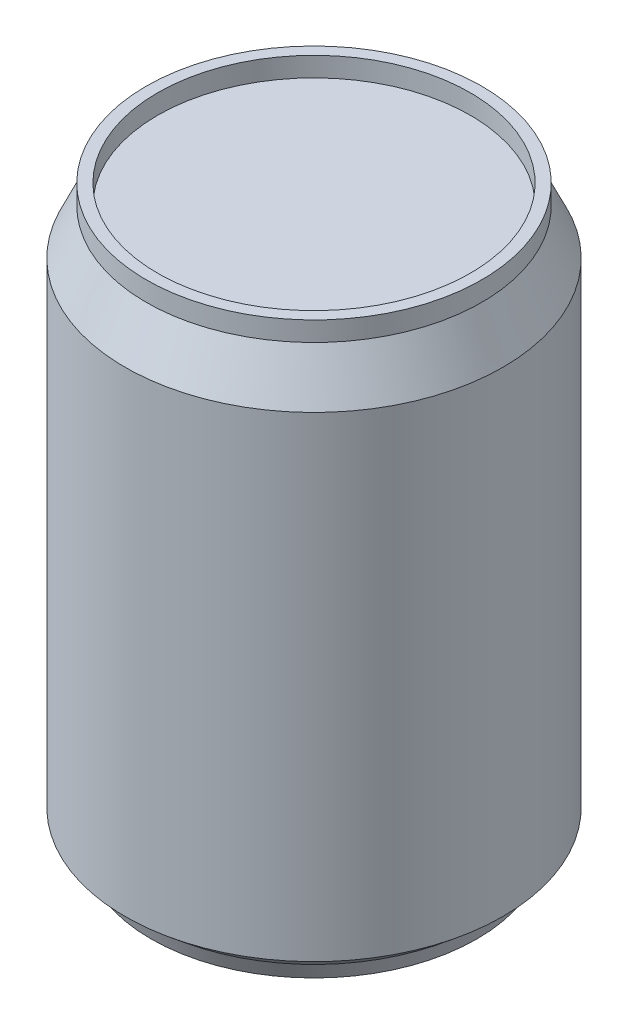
ISO-10303-21;
HEADER;
FILE_DESCRIPTION(('STEP AP214'),'2;1');
FILE_NAME('part.step','',(''),(''),'','','');
FILE_SCHEMA(('AUTOMOTIVE_DESIGN { 1 0 10303 214 1 1 1 1 }'));
ENDSEC;
DATA;
#1=APPLICATION_CONTEXT('core data for automotive mechanical design processes');
#2=APPLICATION_PROTOCOL_DEFINITION('international standard','automotive_design',2000,#1);
#3=PRODUCT_CONTEXT('',#1,'mechanical');
#4=PRODUCT('Part','Part','',(#3));
#5=PRODUCT_RELATED_PRODUCT_CATEGORY('part','',(#4));
#6=PRODUCT_DEFINITION_FORMATION('','',#4);
#7=PRODUCT_DEFINITION_CONTEXT('part definition',#1,'design');
#8=PRODUCT_DEFINITION('design','',#6,#7);
#9=PRODUCT_DEFINITION_SHAPE('','',#8);
#10=(LENGTH_UNIT() NAMED_UNIT(*) SI_UNIT(.MILLI.,.METRE.));
#11=(NAMED_UNIT(*) PLANE_ANGLE_UNIT() SI_UNIT($,.RADIAN.));
#12=(NAMED_UNIT(*) SI_UNIT($,.STERADIAN.) SOLID_ANGLE_UNIT());
#13=UNCERTAINTY_MEASURE_WITH_UNIT(LENGTH_MEASURE(1.E-05),#10,'distance_accuracy_value','');
#14=(GEOMETRIC_REPRESENTATION_CONTEXT(3) GLOBAL_UNCERTAINTY_ASSIGNED_CONTEXT((#13)) GLOBAL_UNIT_ASSIGNED_CONTEXT((#10,
#11,#12)) REPRESENTATION_CONTEXT('',''));
#15=CARTESIAN_POINT('',(0.,0.,0.));
#16=DIRECTION('',(0.,0.,1.));
#17=DIRECTION('',(1.,0.,0.));
#18=AXIS2_PLACEMENT_3D('',#15,#16,#17);
#19=CARTESIAN_POINT('',(0.,85.,0.));
#20=DIRECTION('',(0.,1.,0.));
#21=DIRECTION('',(-1.,0.,0.));
#22=AXIS2_PLACEMENT_3D('',#19,#20,#21);
#23=PLANE('',#22);
#24=CARTESIAN_POINT('',(0.,85.,0.));
#25=DIRECTION('',(0.,1.,0.));
#26=DIRECTION('',(-1.,0.,0.));
#27=AXIS2_PLACEMENT_3D('',#24,#25,#26);
#28=CIRCLE('',#27,24.);
#29=CARTESIAN_POINT('',(-24.,85.,0.));
#30=VERTEX_POINT('',#29);
#31=EDGE_CURVE('E10',#30,#30,#28,.T.);
#32=ORIENTED_EDGE('',*,*,#31,.T.);
#33=EDGE_LOOP('',(#32));
#34=FACE_BOUND('',#33,.T.);
#35=ADVANCED_FACE('F38',(#34),#23,.T.);
#36=CARTESIAN_POINT('',(0.,85.,0.));
#37=DIRECTION('',(0.,1.,0.));
#38=DIRECTION('',(-1.,0.,0.));
#39=AXIS2_PLACEMENT_3D('',#36,#37,#38);
#40=CYLINDRICAL_SURFACE('',#39,24.);
#41=CARTESIAN_POINT('',(0.,88.,0.));
#42=DIRECTION('',(0.,1.,0.));
#43=DIRECTION('',(-1.,0.,0.));
#44=AXIS2_PLACEMENT_3D('',#41,#42,#43);
#45=CIRCLE('',#44,24.);
#46=CARTESIAN_POINT('',(-24.,88.,0.));
#47=VERTEX_POINT('',#46);
#48=EDGE_CURVE('E44',#47,#47,#45,.T.);
#49=ORIENTED_EDGE('',*,*,#48,.T.);
#50=EDGE_LOOP('',(#49));
#51=FACE_BOUND('',#50,.T.);
#52=ORIENTED_EDGE('',*,*,#31,.F.);
#53=EDGE_LOOP('',(#52));
#54=FACE_BOUND('',#53,.T.);
#55=ADVANCED_FACE('F88',(#51,#54),#40,.F.);
#56=CARTESIAN_POINT('',(-24.,88.,0.));
#57=DIRECTION('',(0.,1.,0.));
#58=DIRECTION('',(-1.,0.,0.));
#59=AXIS2_PLACEMENT_3D('',#56,#57,#58);
#60=PLANE('',#59);
#61=CARTESIAN_POINT('',(0.,88.,0.));
#62=DIRECTION('',(0.,1.,0.));
#63=DIRECTION('',(-1.,0.,0.));
#64=AXIS2_PLACEMENT_3D('',#61,#62,#63);
#65=CIRCLE('',#64,25.75);
#66=CARTESIAN_POINT('',(-25.75,88.,0.));
#67=VERTEX_POINT('',#66);
#68=EDGE_CURVE('E48',#67,#67,#65,.T.);
#69=ORIENTED_EDGE('',*,*,#68,.T.);
#70=EDGE_LOOP('',(#69));
#71=FACE_BOUND('',#70,.T.);
#72=ORIENTED_EDGE('',*,*,#48,.F.);
#73=EDGE_LOOP('',(#72));
#74=FACE_BOUND('',#73,.T.);
#75=ADVANCED_FACE('F92',(#71,#74),#60,.T.);
#76=CARTESIAN_POINT('',(0.,85.,0.));
#77=DIRECTION('',(0.,1.,0.));
#78=DIRECTION('',(-1.,0.,0.));
#79=AXIS2_PLACEMENT_3D('',#76,#77,#78);
#80=CYLINDRICAL_SURFACE('',#79,25.75);
#81=CARTESIAN_POINT('',(0.,85.,0.));
#82=DIRECTION('',(0.,1.,0.));
#83=DIRECTION('',(-1.,0.,0.));
#84=AXIS2_PLACEMENT_3D('',#81,#82,#83);
#85=CIRCLE('',#84,25.75);
#86=CARTESIAN_POINT('',(-25.75,85.,0.));
#87=VERTEX_POINT('',#86);
#88=EDGE_CURVE('E52',#87,#87,#85,.T.);
#89=ORIENTED_EDGE('',*,*,#88,.T.);
#90=EDGE_LOOP('',(#89));
#91=FACE_BOUND('',#90,.T.);
#92=ORIENTED_EDGE('',*,*,#68,.F.);
#93=EDGE_LOOP('',(#92));
#94=FACE_BOUND('',#93,.T.);
#95=ADVANCED_FACE('F96',(#91,#94),#80,.T.);
#96=CARTESIAN_POINT('',(0.,85.,0.));
#97=DIRECTION('',(0.,-1.,0.));
#98=DIRECTION('',(1.,0.,0.));
#99=AXIS2_PLACEMENT_3D('',#96,#97,#98);
#100=CONICAL_SURFACE('',#99,25.75,0.434670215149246);
#101=CARTESIAN_POINT('',(0.,78.,0.));
#102=DIRECTION('',(0.,1.,0.));
#103=DIRECTION('',(-1.,0.,0.));
#104=AXIS2_PLACEMENT_3D('',#101,#102,#103);
#105=CIRCLE('',#104,29.);
#106=CARTESIAN_POINT('',(-29.,78.,0.));
#107=VERTEX_POINT('',#106);
#108=EDGE_CURVE('E57',#107,#107,#105,.T.);
#109=ORIENTED_EDGE('',*,*,#108,.T.);
#110=EDGE_LOOP('',(#109));
#111=FACE_BOUND('',#110,.T.);
#112=ORIENTED_EDGE('',*,*,#88,.F.);
#113=EDGE_LOOP('',(#112));
#114=FACE_BOUND('',#113,.T.);
#115=ADVANCED_FACE('F103',(#111,#114),#100,.T.);
#116=CARTESIAN_POINT('',(0.,85.,0.));
#117=DIRECTION('',(0.,1.,0.));
#118=DIRECTION('',(-1.,0.,0.));
#119=AXIS2_PLACEMENT_3D('',#116,#117,#118);
#120=CYLINDRICAL_SURFACE('',#119,29.);
#121=CARTESIAN_POINT('',(0.,5.,0.));
#122=DIRECTION('',(0.,1.,0.));
#123=DIRECTION('',(-1.,0.,0.));
#124=AXIS2_PLACEMENT_3D('',#121,#122,#123);
#125=CIRCLE('',#124,29.);
#126=CARTESIAN_POINT('',(-29.,5.00000000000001,0.));
#127=VERTEX_POINT('',#126);
#128=EDGE_CURVE('E60',#127,#127,#125,.T.);
#129=ORIENTED_EDGE('',*,*,#128,.T.);
#130=EDGE_LOOP('',(#129));
#131=FACE_BOUND('',#130,.T.);
#132=ORIENTED_EDGE('',*,*,#108,.F.);
#133=EDGE_LOOP('',(#132));
#134=FACE_BOUND('',#133,.T.);
#135=ADVANCED_FACE('F107',(#131,#134),#120,.T.);
#136=CARTESIAN_POINT('',(0.,5.,0.));
#137=DIRECTION('',(0.,1.,0.));
#138=DIRECTION('',(-1.,0.,0.));
#139=AXIS2_PLACEMENT_3D('',#136,#137,#138);
#140=CONICAL_SURFACE('',#139,29.,0.876058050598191);
#141=CARTESIAN_POINT('',(0.,2.5,0.));
#142=DIRECTION('',(0.,1.,0.));
#143=DIRECTION('',(-1.,0.,0.));
#144=AXIS2_PLACEMENT_3D('',#141,#142,#143);
#145=CIRCLE('',#144,26.);
#146=CARTESIAN_POINT('',(-26.,2.5,0.));
#147=VERTEX_POINT('',#146);
#148=EDGE_CURVE('E63',#147,#147,#145,.T.);
#149=ORIENTED_EDGE('',*,*,#148,.T.);
#150=EDGE_LOOP('',(#149));
#151=FACE_BOUND('',#150,.T.);
#152=ORIENTED_EDGE('',*,*,#128,.F.);
#153=EDGE_LOOP('',(#152));
#154=FACE_BOUND('',#153,.T.);
#155=ADVANCED_FACE('F111',(#151,#154),#140,.T.);
#156=CARTESIAN_POINT('',(0.,2.5,0.));
#157=DIRECTION('',(0.,1.,0.));
#158=DIRECTION('',(-1.,0.,0.));
#159=AXIS2_PLACEMENT_3D('',#156,#157,#158);
#160=CONICAL_SURFACE('',#159,26.,0.380506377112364);
#161=CARTESIAN_POINT('',(0.,0.,0.));
#162=DIRECTION('',(0.,1.,0.));
#163=DIRECTION('',(-1.,0.,0.));
#164=AXIS2_PLACEMENT_3D('',#161,#162,#163);
#165=CIRCLE('',#164,25.);
#166=CARTESIAN_POINT('',(-25.,0.,0.));
#167=VERTEX_POINT('',#166);
#168=EDGE_CURVE('E66',#167,#167,#165,.T.);
#169=ORIENTED_EDGE('',*,*,#168,.T.);
#170=EDGE_LOOP('',(#169));
#171=FACE_BOUND('',#170,.T.);
#172=ORIENTED_EDGE('',*,*,#148,.F.);
#173=EDGE_LOOP('',(#172));
#174=FACE_BOUND('',#173,.T.);
#175=ADVANCED_FACE('F115',(#171,#174),#160,.T.);
#176=CARTESIAN_POINT('',(-25.,0.,0.));
#177=DIRECTION('',(0.,-1.,0.));
#178=DIRECTION('',(1.,0.,0.));
#179=AXIS2_PLACEMENT_3D('',#176,#177,#178);
#180=PLANE('',#179);
#181=CARTESIAN_POINT('',(0.,0.,0.));
#182=DIRECTION('',(0.,1.,0.));
#183=DIRECTION('',(-1.,0.,0.));
#184=AXIS2_PLACEMENT_3D('',#181,#182,#183);
#185=CIRCLE('',#184,22.);
#186=CARTESIAN_POINT('',(-22.,0.,0.));
#187=VERTEX_POINT('',#186);
#188=EDGE_CURVE('E69',#187,#187,#185,.T.);
#189=ORIENTED_EDGE('',*,*,#188,.T.);
#190=EDGE_LOOP('',(#189));
#191=FACE_BOUND('',#190,.T.);
#192=ORIENTED_EDGE('',*,*,#168,.F.);
#193=EDGE_LOOP('',(#192));
#194=FACE_BOUND('',#193,.T.);
#195=ADVANCED_FACE('F85',(#191,#194),#180,.T.);
#196=CARTESIAN_POINT('',(0.,85.,0.));
#197=DIRECTION('',(0.,1.,0.));
#198=DIRECTION('',(-1.,0.,0.));
#199=AXIS2_PLACEMENT_3D('',#196,#197,#198);
#200=CYLINDRICAL_SURFACE('',#199,22.);
#201=CARTESIAN_POINT('',(0.,2.5,0.));
#202=DIRECTION('',(0.,1.,0.));
#203=DIRECTION('',(-1.,0.,0.));
#204=AXIS2_PLACEMENT_3D('',#201,#202,#203);
#205=CIRCLE('',#204,22.);
#206=CARTESIAN_POINT('',(-22.,2.5,0.));
#207=VERTEX_POINT('',#206);
#208=EDGE_CURVE('E72',#207,#207,#205,.T.);
#209=ORIENTED_EDGE('',*,*,#208,.T.);
#210=EDGE_LOOP('',(#209));
#211=FACE_BOUND('',#210,.T.);
#212=ORIENTED_EDGE('',*,*,#188,.F.);
#213=EDGE_LOOP('',(#212));
#214=FACE_BOUND('',#213,.T.);
#215=ADVANCED_FACE('F76',(#211,#214),#200,.F.);
#216=CARTESIAN_POINT('',(0.,-26.0166666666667,0.));
#217=DIRECTION('',(0.,1.,0.));
#218=DIRECTION('',(-1.,0.,0.));
#219=AXIS2_PLACEMENT_3D('',#216,#217,#218);
#220=SPHERICAL_SURFACE('',#219,36.0166666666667);
#221=ORIENTED_EDGE('',*,*,#208,.F.);
#222=EDGE_LOOP('',(#221));
#223=FACE_BOUND('',#222,.T.);
#224=ADVANCED_FACE('F79',(#223),#220,.F.);
#225=CLOSED_SHELL('',(#35,#55,#75,#95,#115,#135,#155,#175,#195,#215,#224));
#226=MANIFOLD_SOLID_BREP('B2',#225);
#227=ADVANCED_BREP_SHAPE_REPRESENTATION('',(#18,#226),#14);
#228=SHAPE_DEFINITION_REPRESENTATION(#9,#227);
ENDSEC;
END-ISO-10303-21;
